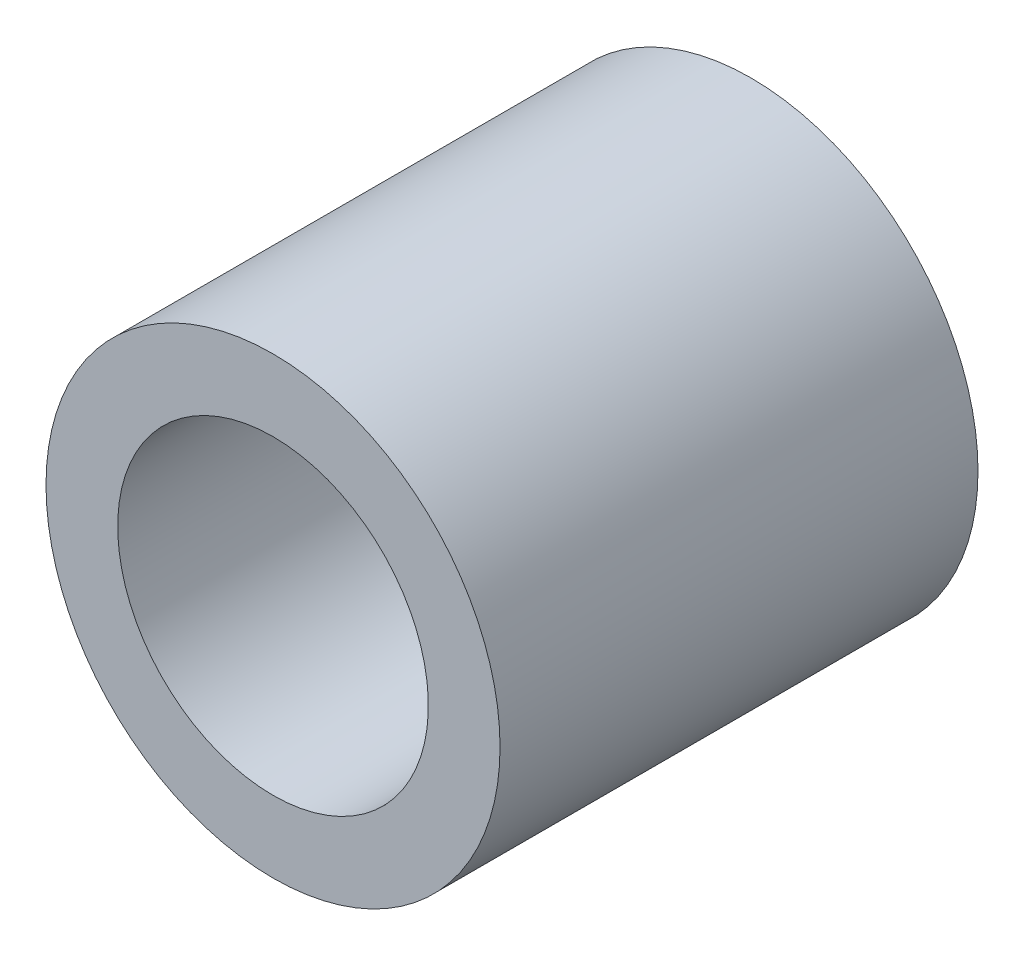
ISO-10303-21;
HEADER;
FILE_DESCRIPTION(('STEP AP214'),'2;1');
FILE_NAME('part.step','',(''),(''),'','','');
FILE_SCHEMA(('AUTOMOTIVE_DESIGN { 1 0 10303 214 1 1 1 1 }'));
ENDSEC;
DATA;
#1=APPLICATION_CONTEXT('core data for automotive mechanical design processes');
#2=APPLICATION_PROTOCOL_DEFINITION('international standard','automotive_design',2000,#1);
#3=PRODUCT_CONTEXT('',#1,'mechanical');
#4=PRODUCT('Part','Part','',(#3));
#5=PRODUCT_RELATED_PRODUCT_CATEGORY('part','',(#4));
#6=PRODUCT_DEFINITION_FORMATION('','',#4);
#7=PRODUCT_DEFINITION_CONTEXT('part definition',#1,'design');
#8=PRODUCT_DEFINITION('design','',#6,#7);
#9=PRODUCT_DEFINITION_SHAPE('','',#8);
#10=(LENGTH_UNIT() NAMED_UNIT(*) SI_UNIT(.MILLI.,.METRE.));
#11=(NAMED_UNIT(*) PLANE_ANGLE_UNIT() SI_UNIT($,.RADIAN.));
#12=(NAMED_UNIT(*) SI_UNIT($,.STERADIAN.) SOLID_ANGLE_UNIT());
#13=UNCERTAINTY_MEASURE_WITH_UNIT(LENGTH_MEASURE(1.E-05),#10,'distance_accuracy_value','');
#14=(GEOMETRIC_REPRESENTATION_CONTEXT(3) GLOBAL_UNCERTAINTY_ASSIGNED_CONTEXT((#13)) GLOBAL_UNIT_ASSIGNED_CONTEXT((#10,
#11,#12)) REPRESENTATION_CONTEXT('',''));
#15=CARTESIAN_POINT('',(0.,0.,0.));
#16=DIRECTION('',(0.,0.,1.));
#17=DIRECTION('',(1.,0.,0.));
#18=AXIS2_PLACEMENT_3D('',#15,#16,#17);
#19=CARTESIAN_POINT('',(9.5,0.,0.));
#20=DIRECTION('',(0.,0.,1.));
#21=DIRECTION('',(0.,-1.,0.));
#22=AXIS2_PLACEMENT_3D('',#19,#20,#21);
#23=PLANE('',#22);
#24=CARTESIAN_POINT('',(0.,0.,0.));
#25=DIRECTION('',(0.,0.,1.));
#26=DIRECTION('',(0.,-1.,0.));
#27=AXIS2_PLACEMENT_3D('',#24,#25,#26);
#28=CIRCLE('',#27,6.5);
#29=CARTESIAN_POINT('',(0.,-6.5,0.));
#30=VERTEX_POINT('',#29);
#31=EDGE_CURVE('E22',#30,#30,#28,.T.);
#32=ORIENTED_EDGE('',*,*,#31,.T.);
#33=EDGE_LOOP('',(#32));
#34=FACE_BOUND('',#33,.T.);
#35=CARTESIAN_POINT('',(0.,0.,0.));
#36=DIRECTION('',(0.,0.,-1.));
#37=DIRECTION('',(0.,1.,0.));
#38=AXIS2_PLACEMENT_3D('',#35,#36,#37);
#39=CIRCLE('',#38,9.5);
#40=CARTESIAN_POINT('',(0.,9.5,0.));
#41=VERTEX_POINT('',#40);
#42=EDGE_CURVE('E8',#41,#41,#39,.T.);
#43=ORIENTED_EDGE('',*,*,#42,.T.);
#44=EDGE_LOOP('',(#43));
#45=FACE_BOUND('',#44,.T.);
#46=ADVANCED_FACE('F12',(#34,#45),#23,.F.);
#47=CARTESIAN_POINT('',(0.,0.,-20.));
#48=DIRECTION('',(0.,0.,-1.));
#49=DIRECTION('',(0.,1.,0.));
#50=AXIS2_PLACEMENT_3D('',#47,#48,#49);
#51=CYLINDRICAL_SURFACE('',#50,9.5);
#52=ORIENTED_EDGE('',*,*,#42,.F.);
#53=EDGE_LOOP('',(#52));
#54=FACE_BOUND('',#53,.T.);
#55=CARTESIAN_POINT('',(0.,0.,20.));
#56=DIRECTION('',(0.,0.,1.));
#57=DIRECTION('',(0.,-1.,0.));
#58=AXIS2_PLACEMENT_3D('',#55,#56,#57);
#59=CIRCLE('',#58,9.5);
#60=CARTESIAN_POINT('',(0.,-9.5,20.));
#61=VERTEX_POINT('',#60);
#62=EDGE_CURVE('E18',#61,#61,#59,.T.);
#63=ORIENTED_EDGE('',*,*,#62,.F.);
#64=EDGE_LOOP('',(#63));
#65=FACE_BOUND('',#64,.T.);
#66=ADVANCED_FACE('F36',(#54,#65),#51,.T.);
#67=CARTESIAN_POINT('',(0.,0.,20.));
#68=DIRECTION('',(0.,0.,1.));
#69=DIRECTION('',(0.,-1.,0.));
#70=AXIS2_PLACEMENT_3D('',#67,#68,#69);
#71=PLANE('',#70);
#72=CARTESIAN_POINT('',(0.,0.,20.));
#73=DIRECTION('',(0.,0.,1.));
#74=DIRECTION('',(0.,-1.,0.));
#75=AXIS2_PLACEMENT_3D('',#72,#73,#74);
#76=CIRCLE('',#75,6.5);
#77=CARTESIAN_POINT('',(0.,-6.5,20.));
#78=VERTEX_POINT('',#77);
#79=EDGE_CURVE('E26',#78,#78,#76,.T.);
#80=ORIENTED_EDGE('',*,*,#79,.F.);
#81=EDGE_LOOP('',(#80));
#82=FACE_BOUND('',#81,.T.);
#83=ORIENTED_EDGE('',*,*,#62,.T.);
#84=EDGE_LOOP('',(#83));
#85=FACE_BOUND('',#84,.T.);
#86=ADVANCED_FACE('F34',(#82,#85),#71,.T.);
#87=CARTESIAN_POINT('',(0.,0.,0.));
#88=DIRECTION('',(0.,0.,1.));
#89=DIRECTION('',(0.,-1.,0.));
#90=AXIS2_PLACEMENT_3D('',#87,#88,#89);
#91=CYLINDRICAL_SURFACE('',#90,6.5);
#92=ORIENTED_EDGE('',*,*,#31,.F.);
#93=EDGE_LOOP('',(#92));
#94=FACE_BOUND('',#93,.T.);
#95=ORIENTED_EDGE('',*,*,#79,.T.);
#96=EDGE_LOOP('',(#95));
#97=FACE_BOUND('',#96,.T.);
#98=ADVANCED_FACE('F32',(#94,#97),#91,.F.);
#99=CLOSED_SHELL('',(#46,#66,#86,#98));
#100=MANIFOLD_SOLID_BREP('B1',#99);
#101=ADVANCED_BREP_SHAPE_REPRESENTATION('',(#18,#100),#14);
#102=SHAPE_DEFINITION_REPRESENTATION(#9,#101);
ENDSEC;
END-ISO-10303-21;
